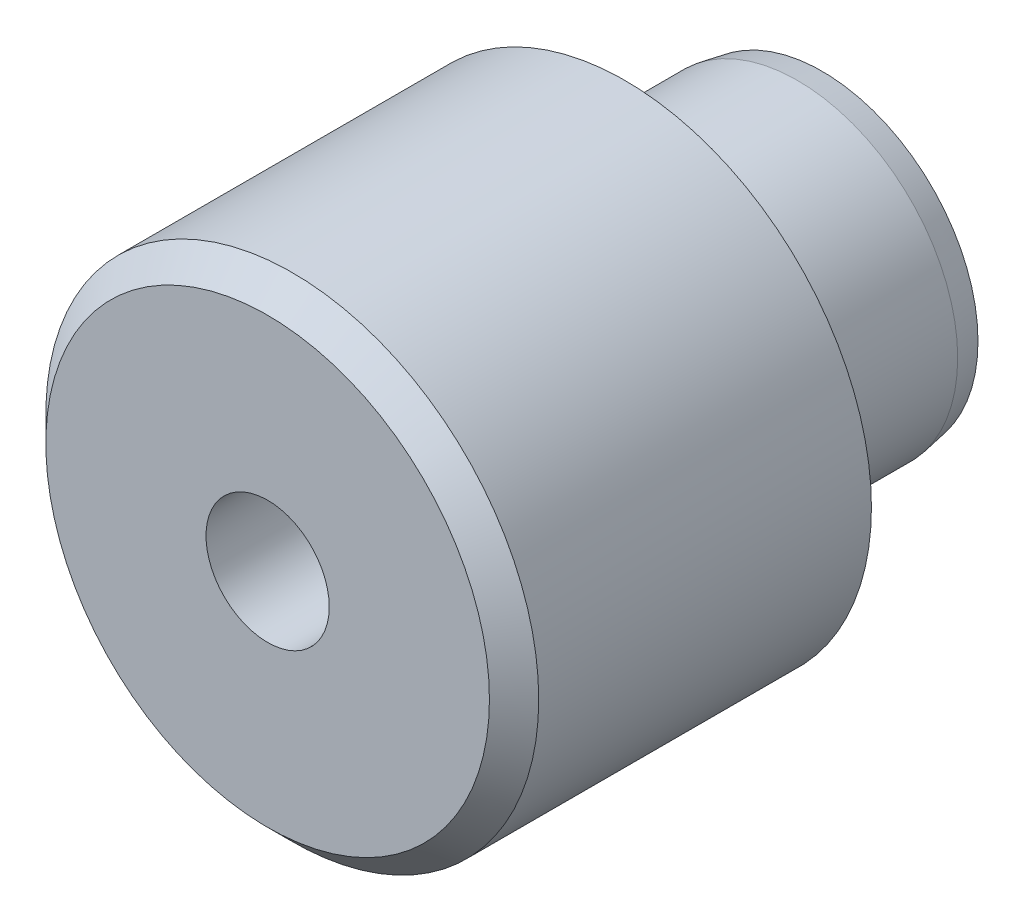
ISO-10303-21;
HEADER;
FILE_DESCRIPTION(('STEP AP214'),'2;1');
FILE_NAME('part.step','',(''),(''),'','','');
FILE_SCHEMA(('AUTOMOTIVE_DESIGN { 1 0 10303 214 1 1 1 1 }'));
ENDSEC;
DATA;
#1=APPLICATION_CONTEXT('core data for automotive mechanical design processes');
#2=APPLICATION_PROTOCOL_DEFINITION('international standard','automotive_design',2000,#1);
#3=PRODUCT_CONTEXT('',#1,'mechanical');
#4=PRODUCT('Part','Part','',(#3));
#5=PRODUCT_RELATED_PRODUCT_CATEGORY('part','',(#4));
#6=PRODUCT_DEFINITION_FORMATION('','',#4);
#7=PRODUCT_DEFINITION_CONTEXT('part definition',#1,'design');
#8=PRODUCT_DEFINITION('design','',#6,#7);
#9=PRODUCT_DEFINITION_SHAPE('','',#8);
#10=(LENGTH_UNIT() NAMED_UNIT(*) SI_UNIT(.MILLI.,.METRE.));
#11=(NAMED_UNIT(*) PLANE_ANGLE_UNIT() SI_UNIT($,.RADIAN.));
#12=(NAMED_UNIT(*) SI_UNIT($,.STERADIAN.) SOLID_ANGLE_UNIT());
#13=UNCERTAINTY_MEASURE_WITH_UNIT(LENGTH_MEASURE(1.E-05),#10,'distance_accuracy_value','');
#14=(GEOMETRIC_REPRESENTATION_CONTEXT(3) GLOBAL_UNCERTAINTY_ASSIGNED_CONTEXT((#13)) GLOBAL_UNIT_ASSIGNED_CONTEXT((#10,
#11,#12)) REPRESENTATION_CONTEXT('',''));
#15=CARTESIAN_POINT('',(0.,0.,0.));
#16=DIRECTION('',(0.,0.,1.));
#17=DIRECTION('',(1.,0.,0.));
#18=AXIS2_PLACEMENT_3D('',#15,#16,#17);
#19=CARTESIAN_POINT('',(0.,0.,0.5));
#20=DIRECTION('',(0.,0.,-1.));
#21=DIRECTION('',(-1.,0.,0.));
#22=AXIS2_PLACEMENT_3D('',#19,#20,#21);
#23=PLANE('',#22);
#24=CARTESIAN_POINT('',(0.,0.,0.5));
#25=DIRECTION('',(0.,0.,-1.));
#26=DIRECTION('',(-1.,0.,0.));
#27=AXIS2_PLACEMENT_3D('',#24,#25,#26);
#28=CIRCLE('',#27,7.3);
#29=CARTESIAN_POINT('',(-7.3,0.,0.500000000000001));
#30=VERTEX_POINT('',#29);
#31=EDGE_CURVE('E73',#30,#30,#28,.F.);
#32=ORIENTED_EDGE('',*,*,#31,.T.);
#33=EDGE_LOOP('',(#32));
#34=FACE_BOUND('',#33,.T.);
#35=CARTESIAN_POINT('',(0.,0.,0.499999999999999));
#36=DIRECTION('',(0.,0.,1.));
#37=DIRECTION('',(1.,0.,0.));
#38=AXIS2_PLACEMENT_3D('',#35,#36,#37);
#39=CIRCLE('',#38,10.);
#40=CARTESIAN_POINT('',(10.,0.,0.499999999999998));
#41=VERTEX_POINT('',#40);
#42=EDGE_CURVE('E70',#41,#41,#39,.T.);
#43=ORIENTED_EDGE('',*,*,#42,.F.);
#44=EDGE_LOOP('',(#43));
#45=FACE_BOUND('',#44,.T.);
#46=ADVANCED_FACE('F39',(#34,#45),#23,.T.);
#47=CARTESIAN_POINT('',(0.,0.,0.5));
#48=DIRECTION('',(0.,0.,1.));
#49=DIRECTION('',(1.,0.,0.));
#50=AXIS2_PLACEMENT_3D('',#47,#48,#49);
#51=CYLINDRICAL_SURFACE('',#50,10.);
#52=CARTESIAN_POINT('',(0.,0.,14.));
#53=DIRECTION('',(0.,0.,1.));
#54=DIRECTION('',(1.,0.,0.));
#55=AXIS2_PLACEMENT_3D('',#52,#53,#54);
#56=CIRCLE('',#55,10.);
#57=CARTESIAN_POINT('',(10.,0.,14.));
#58=VERTEX_POINT('',#57);
#59=EDGE_CURVE('E11',#58,#58,#56,.F.);
#60=ORIENTED_EDGE('',*,*,#59,.T.);
#61=EDGE_LOOP('',(#60));
#62=FACE_BOUND('',#61,.T.);
#63=ORIENTED_EDGE('',*,*,#42,.T.);
#64=EDGE_LOOP('',(#63));
#65=FACE_BOUND('',#64,.T.);
#66=ADVANCED_FACE('F93',(#62,#65),#51,.T.);
#67=CARTESIAN_POINT('',(0.,0.,15.));
#68=DIRECTION('',(0.,0.,1.));
#69=DIRECTION('',(1.,0.,0.));
#70=AXIS2_PLACEMENT_3D('',#67,#68,#69);
#71=PLANE('',#70);
#72=CARTESIAN_POINT('',(0.,0.,15.));
#73=DIRECTION('',(0.,0.,1.));
#74=DIRECTION('',(1.,0.,0.));
#75=AXIS2_PLACEMENT_3D('',#72,#73,#74);
#76=CIRCLE('',#75,9.);
#77=CARTESIAN_POINT('',(9.,0.,15.));
#78=VERTEX_POINT('',#77);
#79=EDGE_CURVE('E46',#78,#78,#76,.T.);
#80=ORIENTED_EDGE('',*,*,#79,.T.);
#81=EDGE_LOOP('',(#80));
#82=FACE_BOUND('',#81,.T.);
#83=CARTESIAN_POINT('',(0.,0.,15.));
#84=DIRECTION('',(0.,0.,1.));
#85=DIRECTION('',(1.,0.,0.));
#86=AXIS2_PLACEMENT_3D('',#83,#84,#85);
#87=CIRCLE('',#86,2.5);
#88=CARTESIAN_POINT('',(2.5,0.,15.));
#89=VERTEX_POINT('',#88);
#90=EDGE_CURVE('E60',#89,#89,#87,.T.);
#91=ORIENTED_EDGE('',*,*,#90,.F.);
#92=EDGE_LOOP('',(#91));
#93=FACE_BOUND('',#92,.T.);
#94=ADVANCED_FACE('F81',(#82,#93),#71,.T.);
#95=CARTESIAN_POINT('',(0.,0.,-7.5));
#96=DIRECTION('',(0.,0.,1.));
#97=DIRECTION('',(1.,0.,0.));
#98=AXIS2_PLACEMENT_3D('',#95,#96,#97);
#99=CYLINDRICAL_SURFACE('',#98,6.5);
#100=CARTESIAN_POINT('',(0.,0.,-0.3));
#101=DIRECTION('',(0.,0.,-1.));
#102=DIRECTION('',(-1.,0.,0.));
#103=AXIS2_PLACEMENT_3D('',#100,#101,#102);
#104=CIRCLE('',#103,6.5);
#105=CARTESIAN_POINT('',(-6.5,0.,-0.299999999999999));
#106=VERTEX_POINT('',#105);
#107=EDGE_CURVE('E76',#106,#106,#104,.T.);
#108=ORIENTED_EDGE('',*,*,#107,.T.);
#109=EDGE_LOOP('',(#108));
#110=FACE_BOUND('',#109,.T.);
#111=CARTESIAN_POINT('',(0.,0.,-6.5));
#112=DIRECTION('',(0.,0.,1.));
#113=DIRECTION('',(1.,0.,0.));
#114=AXIS2_PLACEMENT_3D('',#111,#112,#113);
#115=CIRCLE('',#114,6.5);
#116=CARTESIAN_POINT('',(6.5,0.,-6.5));
#117=VERTEX_POINT('',#116);
#118=EDGE_CURVE('E63',#117,#117,#115,.T.);
#119=ORIENTED_EDGE('',*,*,#118,.T.);
#120=EDGE_LOOP('',(#119));
#121=FACE_BOUND('',#120,.T.);
#122=ADVANCED_FACE('F105',(#110,#121),#99,.T.);
#123=CARTESIAN_POINT('',(0.,0.,-6.5));
#124=DIRECTION('',(0.,0.,1.));
#125=DIRECTION('',(1.,0.,0.));
#126=AXIS2_PLACEMENT_3D('',#123,#124,#125);
#127=CONICAL_SURFACE('',#126,6.5,0.174532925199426);
#128=CARTESIAN_POINT('',(0.,0.,-7.5));
#129=DIRECTION('',(0.,0.,1.));
#130=DIRECTION('',(1.,0.,0.));
#131=AXIS2_PLACEMENT_3D('',#128,#129,#130);
#132=CIRCLE('',#131,6.32367301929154);
#133=CARTESIAN_POINT('',(6.32367301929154,0.,-7.5));
#134=VERTEX_POINT('',#133);
#135=EDGE_CURVE('E59',#134,#134,#132,.T.);
#136=ORIENTED_EDGE('',*,*,#135,.T.);
#137=EDGE_LOOP('',(#136));
#138=FACE_BOUND('',#137,.T.);
#139=ORIENTED_EDGE('',*,*,#118,.F.);
#140=EDGE_LOOP('',(#139));
#141=FACE_BOUND('',#140,.T.);
#142=ADVANCED_FACE('F108',(#138,#141),#127,.T.);
#143=CARTESIAN_POINT('',(0.,0.,-7.5));
#144=DIRECTION('',(0.,0.,-1.));
#145=DIRECTION('',(-1.,0.,0.));
#146=AXIS2_PLACEMENT_3D('',#143,#144,#145);
#147=PLANE('',#146);
#148=ORIENTED_EDGE('',*,*,#135,.F.);
#149=EDGE_LOOP('',(#148));
#150=FACE_BOUND('',#149,.T.);
#151=ADVANCED_FACE('F53',(#150),#147,.T.);
#152=CARTESIAN_POINT('',(0.,0.,0.));
#153=DIRECTION('',(0.,0.,1.));
#154=DIRECTION('',(1.,0.,0.));
#155=AXIS2_PLACEMENT_3D('',#152,#153,#154);
#156=CONICAL_SURFACE('',#155,2.5,1.02974425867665);
#157=CARTESIAN_POINT('',(0.,0.,-1.5021515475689));
#158=VERTEX_POINT('',#157);
#159=VERTEX_LOOP('',#158);
#160=FACE_BOUND('',#159,.T.);
#161=CARTESIAN_POINT('',(0.,0.,0.));
#162=DIRECTION('',(0.,0.,1.));
#163=DIRECTION('',(1.,0.,0.));
#164=AXIS2_PLACEMENT_3D('',#161,#162,#163);
#165=CIRCLE('',#164,2.5);
#166=CARTESIAN_POINT('',(2.5,0.,0.));
#167=VERTEX_POINT('',#166);
#168=EDGE_CURVE('E57',#167,#167,#165,.T.);
#169=ORIENTED_EDGE('',*,*,#168,.T.);
#170=EDGE_LOOP('',(#169));
#171=FACE_BOUND('',#170,.T.);
#172=ADVANCED_FACE('F49',(#160,#171),#156,.F.);
#173=CARTESIAN_POINT('',(0.,0.,15.));
#174=DIRECTION('',(0.,0.,1.));
#175=DIRECTION('',(1.,0.,0.));
#176=AXIS2_PLACEMENT_3D('',#173,#174,#175);
#177=CYLINDRICAL_SURFACE('',#176,2.5);
#178=ORIENTED_EDGE('',*,*,#168,.F.);
#179=EDGE_LOOP('',(#178));
#180=FACE_BOUND('',#179,.T.);
#181=ORIENTED_EDGE('',*,*,#90,.T.);
#182=EDGE_LOOP('',(#181));
#183=FACE_BOUND('',#182,.T.);
#184=ADVANCED_FACE('F52',(#180,#183),#177,.F.);
#185=CARTESIAN_POINT('',(0.,0.,-0.3));
#186=DIRECTION('',(0.,0.,-1.));
#187=DIRECTION('',(-1.,0.,0.));
#188=AXIS2_PLACEMENT_3D('',#185,#186,#187);
#189=TOROIDAL_SURFACE('',#188,7.3,0.8);
#190=ORIENTED_EDGE('',*,*,#107,.F.);
#191=EDGE_LOOP('',(#190));
#192=FACE_BOUND('',#191,.T.);
#193=ORIENTED_EDGE('',*,*,#31,.F.);
#194=EDGE_LOOP('',(#193));
#195=FACE_BOUND('',#194,.T.);
#196=ADVANCED_FACE('F85',(#192,#195),#189,.F.);
#197=CARTESIAN_POINT('',(0.,0.,15.));
#198=DIRECTION('',(0.,0.,-1.));
#199=DIRECTION('',(-1.,0.,0.));
#200=AXIS2_PLACEMENT_3D('',#197,#198,#199);
#201=CONICAL_SURFACE('',#200,9.,0.785398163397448);
#202=ORIENTED_EDGE('',*,*,#59,.F.);
#203=EDGE_LOOP('',(#202));
#204=FACE_BOUND('',#203,.T.);
#205=ORIENTED_EDGE('',*,*,#79,.F.);
#206=EDGE_LOOP('',(#205));
#207=FACE_BOUND('',#206,.T.);
#208=ADVANCED_FACE('F41',(#204,#207),#201,.T.);
#209=CLOSED_SHELL('',(#46,#66,#94,#122,#142,#151,#172,#184,#196,#208));
#210=MANIFOLD_SOLID_BREP('B2',#209);
#211=ADVANCED_BREP_SHAPE_REPRESENTATION('',(#18,#210),#14);
#212=SHAPE_DEFINITION_REPRESENTATION(#9,#211);
ENDSEC;
END-ISO-10303-21;
